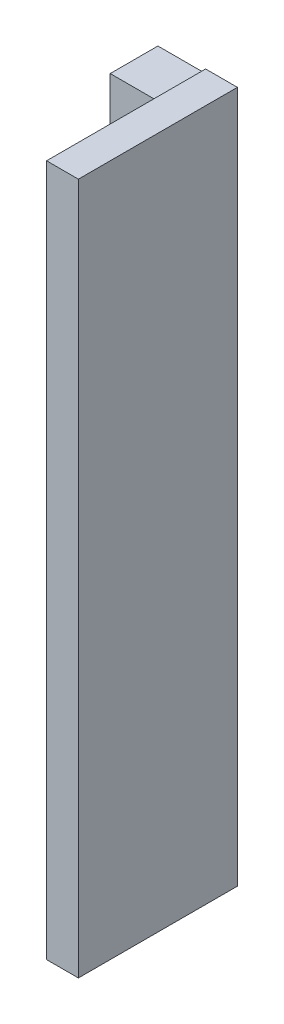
ISO-10303-21;
HEADER;
FILE_DESCRIPTION(('STEP AP214'),'2;1');
FILE_NAME('part.step','',(''),(''),'','','');
FILE_SCHEMA(('AUTOMOTIVE_DESIGN { 1 0 10303 214 1 1 1 1 }'));
ENDSEC;
DATA;
#1=APPLICATION_CONTEXT('core data for automotive mechanical design processes');
#2=APPLICATION_PROTOCOL_DEFINITION('international standard','automotive_design',2000,#1);
#3=PRODUCT_CONTEXT('',#1,'mechanical');
#4=PRODUCT('Part','Part','',(#3));
#5=PRODUCT_RELATED_PRODUCT_CATEGORY('part','',(#4));
#6=PRODUCT_DEFINITION_FORMATION('','',#4);
#7=PRODUCT_DEFINITION_CONTEXT('part definition',#1,'design');
#8=PRODUCT_DEFINITION('design','',#6,#7);
#9=PRODUCT_DEFINITION_SHAPE('','',#8);
#10=(LENGTH_UNIT() NAMED_UNIT(*) SI_UNIT(.MILLI.,.METRE.));
#11=(NAMED_UNIT(*) PLANE_ANGLE_UNIT() SI_UNIT($,.RADIAN.));
#12=(NAMED_UNIT(*) SI_UNIT($,.STERADIAN.) SOLID_ANGLE_UNIT());
#13=UNCERTAINTY_MEASURE_WITH_UNIT(LENGTH_MEASURE(1.E-05),#10,'distance_accuracy_value','');
#14=(GEOMETRIC_REPRESENTATION_CONTEXT(3) GLOBAL_UNCERTAINTY_ASSIGNED_CONTEXT((#13)) GLOBAL_UNIT_ASSIGNED_CONTEXT((#10,
#11,#12)) REPRESENTATION_CONTEXT('',''));
#15=CARTESIAN_POINT('',(0.,0.,0.));
#16=DIRECTION('',(0.,0.,1.));
#17=DIRECTION('',(1.,0.,0.));
#18=AXIS2_PLACEMENT_3D('',#15,#16,#17);
#19=CARTESIAN_POINT('',(3.89999999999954,-43.5,0.));
#20=DIRECTION('',(0.,1.,0.));
#21=DIRECTION('',(-1.,0.,0.));
#22=AXIS2_PLACEMENT_3D('',#19,#20,#21);
#23=PLANE('',#22);
#24=DIRECTION('',(1.,0.,0.));
#25=VECTOR('',#24,1.);
#26=CARTESIAN_POINT('',(3.89999999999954,-43.5,0.));
#27=LINE('',#26,#25);
#28=CARTESIAN_POINT('',(-4.55581752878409E-13,-43.5,0.));
#29=VERTEX_POINT('',#28);
#30=CARTESIAN_POINT('',(3.99999999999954,-43.5,0.));
#31=VERTEX_POINT('',#30);
#32=EDGE_CURVE('E46',#29,#31,#27,.T.);
#33=ORIENTED_EDGE('',*,*,#32,.T.);
#34=DIRECTION('',(0.,0.,-1.));
#35=VECTOR('',#34,1.);
#36=CARTESIAN_POINT('',(3.9999999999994,-43.5,20.));
#37=LINE('',#36,#35);
#38=CARTESIAN_POINT('',(3.9999999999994,-43.5,20.));
#39=VERTEX_POINT('',#38);
#40=EDGE_CURVE('E134',#39,#31,#37,.T.);
#41=ORIENTED_EDGE('',*,*,#40,.F.);
#42=DIRECTION('',(1.,0.,0.));
#43=VECTOR('',#42,1.);
#44=CARTESIAN_POINT('',(-5.60315682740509E-13,-43.5,20.));
#45=LINE('',#44,#43);
#46=CARTESIAN_POINT('',(-5.60315682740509E-13,-43.5,20.));
#47=VERTEX_POINT('',#46);
#48=EDGE_CURVE('E139',#47,#39,#45,.T.);
#49=ORIENTED_EDGE('',*,*,#48,.F.);
#50=DIRECTION('',(0.,0.,-1.));
#51=VECTOR('',#50,1.);
#52=CARTESIAN_POINT('',(-4.55581752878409E-13,-43.5,0.));
#53=LINE('',#52,#51);
#54=EDGE_CURVE('E109',#47,#29,#53,.T.);
#55=ORIENTED_EDGE('',*,*,#54,.T.);
#56=EDGE_LOOP('',(#33,#41,#49,#55));
#57=FACE_BOUND('',#56,.T.);
#58=ADVANCED_FACE('F16',(#57),#23,.F.);
#59=CARTESIAN_POINT('',(3.90000000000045,43.5,0.));
#60=DIRECTION('',(0.,1.,0.));
#61=DIRECTION('',(-1.,0.,0.));
#62=AXIS2_PLACEMENT_3D('',#59,#60,#61);
#63=PLANE('',#62);
#64=DIRECTION('',(-1.,0.,0.));
#65=VECTOR('',#64,1.);
#66=CARTESIAN_POINT('',(3.90000000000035,43.5,20.));
#67=LINE('',#66,#65);
#68=CARTESIAN_POINT('',(4.00000000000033,43.5,20.));
#69=VERTEX_POINT('',#68);
#70=CARTESIAN_POINT('',(3.50847823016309E-13,43.5,20.));
#71=VERTEX_POINT('',#70);
#72=EDGE_CURVE('E125',#69,#71,#67,.T.);
#73=ORIENTED_EDGE('',*,*,#72,.F.);
#74=DIRECTION('',(0.,0.,1.));
#75=VECTOR('',#74,1.);
#76=CARTESIAN_POINT('',(4.00000000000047,43.5,0.));
#77=LINE('',#76,#75);
#78=CARTESIAN_POINT('',(4.00000000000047,43.5,0.));
#79=VERTEX_POINT('',#78);
#80=EDGE_CURVE('E123',#79,#69,#77,.T.);
#81=ORIENTED_EDGE('',*,*,#80,.F.);
#82=DIRECTION('',(1.,0.,0.));
#83=VECTOR('',#82,1.);
#84=CARTESIAN_POINT('',(3.90000000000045,43.5,0.));
#85=LINE('',#84,#83);
#86=CARTESIAN_POINT('',(4.55581752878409E-13,43.5,0.));
#87=VERTEX_POINT('',#86);
#88=EDGE_CURVE('E20',#87,#79,#85,.T.);
#89=ORIENTED_EDGE('',*,*,#88,.F.);
#90=DIRECTION('',(0.,0.,-1.));
#91=VECTOR('',#90,1.);
#92=CARTESIAN_POINT('',(4.55581752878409E-13,43.5,0.));
#93=LINE('',#92,#91);
#94=EDGE_CURVE('E111',#71,#87,#93,.T.);
#95=ORIENTED_EDGE('',*,*,#94,.F.);
#96=EDGE_LOOP('',(#73,#81,#89,#95));
#97=FACE_BOUND('',#96,.T.);
#98=ADVANCED_FACE('F124',(#97),#63,.T.);
#99=CARTESIAN_POINT('',(3.90000000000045,43.5,0.));
#100=DIRECTION('',(0.,0.,1.));
#101=DIRECTION('',(1.,0.,0.));
#102=AXIS2_PLACEMENT_3D('',#99,#100,#101);
#103=PLANE('',#102);
#104=ORIENTED_EDGE('',*,*,#88,.T.);
#105=DIRECTION('',(0.,1.,0.));
#106=VECTOR('',#105,1.);
#107=CARTESIAN_POINT('',(3.99999999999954,-43.5,0.));
#108=LINE('',#107,#106);
#109=EDGE_CURVE('E117',#31,#79,#108,.T.);
#110=ORIENTED_EDGE('',*,*,#109,.F.);
#111=ORIENTED_EDGE('',*,*,#32,.F.);
#112=DIRECTION('',(0.,-1.,0.));
#113=VECTOR('',#112,1.);
#114=CARTESIAN_POINT('',(4.55581752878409E-13,43.5,0.));
#115=LINE('',#114,#113);
#116=CARTESIAN_POINT('',(-4.50377582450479E-13,-43.,0.));
#117=VERTEX_POINT('',#116);
#118=EDGE_CURVE('E107',#29,#117,#115,.F.);
#119=ORIENTED_EDGE('',*,*,#118,.T.);
#120=DIRECTION('',(1.,0.,0.));
#121=VECTOR('',#120,1.);
#122=CARTESIAN_POINT('',(-4.50377582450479E-13,-43.,0.));
#123=LINE('',#122,#121);
#124=CARTESIAN_POINT('',(-6.00000000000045,-43.,0.));
#125=VERTEX_POINT('',#124);
#126=EDGE_CURVE('E100',#125,#117,#123,.T.);
#127=ORIENTED_EDGE('',*,*,#126,.F.);
#128=DIRECTION('',(0.,-1.,0.));
#129=VECTOR('',#128,1.);
#130=CARTESIAN_POINT('',(-5.99999999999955,43.,-1.05821534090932E-13));
#131=LINE('',#130,#129);
#132=CARTESIAN_POINT('',(-5.99999999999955,43.,-1.09290981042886E-13));
#133=VERTEX_POINT('',#132);
#134=EDGE_CURVE('E34',#125,#133,#131,.F.);
#135=ORIENTED_EDGE('',*,*,#134,.T.);
#136=DIRECTION('',(1.,0.,0.));
#137=VECTOR('',#136,1.);
#138=CARTESIAN_POINT('',(4.50377582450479E-13,43.,0.));
#139=LINE('',#138,#137);
#140=CARTESIAN_POINT('',(4.50377582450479E-13,43.,0.));
#141=VERTEX_POINT('',#140);
#142=EDGE_CURVE('E10',#133,#141,#139,.T.);
#143=ORIENTED_EDGE('',*,*,#142,.T.);
#144=EDGE_CURVE('E97',#141,#87,#115,.F.);
#145=ORIENTED_EDGE('',*,*,#144,.T.);
#146=EDGE_LOOP('',(#104,#110,#111,#119,#127,#135,#143,#145));
#147=FACE_BOUND('',#146,.T.);
#148=ADVANCED_FACE('F18',(#147),#103,.F.);
#149=CARTESIAN_POINT('',(3.50847823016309E-13,43.5,15.));
#150=DIRECTION('',(1.,0.,0.));
#151=DIRECTION('',(0.,0.,-1.));
#152=AXIS2_PLACEMENT_3D('',#149,#150,#151);
#153=PLANE('',#152);
#154=DIRECTION('',(0.,0.,1.));
#155=VECTOR('',#154,1.);
#156=CARTESIAN_POINT('',(5.38197958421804E-13,43.,-9.));
#157=LINE('',#156,#155);
#158=CARTESIAN_POINT('',(4.08527378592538E-13,43.,6.));
#159=VERTEX_POINT('',#158);
#160=EDGE_CURVE('E94',#141,#159,#157,.T.);
#161=ORIENTED_EDGE('',*,*,#160,.T.);
#162=DIRECTION('',(0.,-1.,0.));
#163=VECTOR('',#162,1.);
#164=CARTESIAN_POINT('',(4.08527378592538E-13,43.,6.));
#165=LINE('',#164,#163);
#166=CARTESIAN_POINT('',(-4.92227786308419E-13,-43.,6.));
#167=VERTEX_POINT('',#166);
#168=EDGE_CURVE('E82',#167,#159,#165,.F.);
#169=ORIENTED_EDGE('',*,*,#168,.F.);
#170=DIRECTION('',(0.,0.,1.));
#171=VECTOR('',#170,1.);
#172=CARTESIAN_POINT('',(-3.8749385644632E-13,-43.,-9.));
#173=LINE('',#172,#171);
#174=EDGE_CURVE('E146',#117,#167,#173,.T.);
#175=ORIENTED_EDGE('',*,*,#174,.F.);
#176=ORIENTED_EDGE('',*,*,#118,.F.);
#177=ORIENTED_EDGE('',*,*,#54,.F.);
#178=DIRECTION('',(0.,-1.,0.));
#179=VECTOR('',#178,1.);
#180=CARTESIAN_POINT('',(3.50847823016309E-13,43.5,20.));
#181=LINE('',#180,#179);
#182=EDGE_CURVE('E57',#71,#47,#181,.T.);
#183=ORIENTED_EDGE('',*,*,#182,.F.);
#184=ORIENTED_EDGE('',*,*,#94,.T.);
#185=ORIENTED_EDGE('',*,*,#144,.F.);
#186=EDGE_LOOP('',(#161,#169,#175,#176,#177,#183,#184,#185));
#187=FACE_BOUND('',#186,.T.);
#188=ADVANCED_FACE('F95',(#187),#153,.F.);
#189=CARTESIAN_POINT('',(-3.8749385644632E-13,-43.,-9.));
#190=DIRECTION('',(0.,1.,0.));
#191=DIRECTION('',(-1.,0.,0.));
#192=AXIS2_PLACEMENT_3D('',#189,#190,#191);
#193=PLANE('',#192);
#194=DIRECTION('',(0.,0.,-1.));
#195=VECTOR('',#194,1.);
#196=CARTESIAN_POINT('',(-6.00000000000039,-43.,-9.));
#197=LINE('',#196,#195);
#198=CARTESIAN_POINT('',(-6.00000000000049,-43.,6.));
#199=VERTEX_POINT('',#198);
#200=EDGE_CURVE('E149',#199,#125,#197,.T.);
#201=ORIENTED_EDGE('',*,*,#200,.T.);
#202=ORIENTED_EDGE('',*,*,#126,.T.);
#203=ORIENTED_EDGE('',*,*,#174,.T.);
#204=DIRECTION('',(-1.,0.,0.));
#205=VECTOR('',#204,1.);
#206=CARTESIAN_POINT('',(-4.92227786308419E-13,-43.,6.));
#207=LINE('',#206,#205);
#208=EDGE_CURVE('E90',#167,#199,#207,.T.);
#209=ORIENTED_EDGE('',*,*,#208,.T.);
#210=EDGE_LOOP('',(#201,#202,#203,#209));
#211=FACE_BOUND('',#210,.T.);
#212=ADVANCED_FACE('F152',(#211),#193,.F.);
#213=CARTESIAN_POINT('',(5.38197958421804E-13,43.,-9.));
#214=DIRECTION('',(0.,1.,0.));
#215=DIRECTION('',(-1.,0.,0.));
#216=AXIS2_PLACEMENT_3D('',#213,#214,#215);
#217=PLANE('',#216);
#218=ORIENTED_EDGE('',*,*,#142,.F.);
#219=DIRECTION('',(0.,0.,-1.));
#220=VECTOR('',#219,1.);
#221=CARTESIAN_POINT('',(-5.99999999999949,43.,-9.));
#222=LINE('',#221,#220);
#223=CARTESIAN_POINT('',(-5.99999999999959,43.,6.));
#224=VERTEX_POINT('',#223);
#225=EDGE_CURVE('E26',#224,#133,#222,.T.);
#226=ORIENTED_EDGE('',*,*,#225,.F.);
#227=DIRECTION('',(-1.,0.,0.));
#228=VECTOR('',#227,1.);
#229=CARTESIAN_POINT('',(4.08527378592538E-13,43.,6.));
#230=LINE('',#229,#228);
#231=EDGE_CURVE('E87',#159,#224,#230,.T.);
#232=ORIENTED_EDGE('',*,*,#231,.F.);
#233=ORIENTED_EDGE('',*,*,#160,.F.);
#234=EDGE_LOOP('',(#218,#226,#232,#233));
#235=FACE_BOUND('',#234,.T.);
#236=ADVANCED_FACE('F102',(#235),#217,.T.);
#237=CARTESIAN_POINT('',(4.08527378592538E-13,43.,6.));
#238=DIRECTION('',(0.,0.,-1.));
#239=DIRECTION('',(-1.,0.,0.));
#240=AXIS2_PLACEMENT_3D('',#237,#238,#239);
#241=PLANE('',#240);
#242=ORIENTED_EDGE('',*,*,#231,.T.);
#243=DIRECTION('',(0.,-1.,0.));
#244=VECTOR('',#243,1.);
#245=CARTESIAN_POINT('',(-5.99999999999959,43.,6.));
#246=LINE('',#245,#244);
#247=EDGE_CURVE('E144',#199,#224,#246,.F.);
#248=ORIENTED_EDGE('',*,*,#247,.F.);
#249=ORIENTED_EDGE('',*,*,#208,.F.);
#250=ORIENTED_EDGE('',*,*,#168,.T.);
#251=EDGE_LOOP('',(#242,#248,#249,#250));
#252=FACE_BOUND('',#251,.T.);
#253=ADVANCED_FACE('F84',(#252),#241,.F.);
#254=CARTESIAN_POINT('',(-5.99999999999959,43.,6.));
#255=DIRECTION('',(1.,0.,0.));
#256=DIRECTION('',(0.,0.,-1.));
#257=AXIS2_PLACEMENT_3D('',#254,#255,#256);
#258=PLANE('',#257);
#259=ORIENTED_EDGE('',*,*,#225,.T.);
#260=ORIENTED_EDGE('',*,*,#134,.F.);
#261=ORIENTED_EDGE('',*,*,#200,.F.);
#262=ORIENTED_EDGE('',*,*,#247,.T.);
#263=EDGE_LOOP('',(#259,#260,#261,#262));
#264=FACE_BOUND('',#263,.T.);
#265=ADVANCED_FACE('F155',(#264),#258,.F.);
#266=CARTESIAN_POINT('',(0.,0.,20.));
#267=DIRECTION('',(0.,0.,1.));
#268=DIRECTION('',(1.,0.,0.));
#269=AXIS2_PLACEMENT_3D('',#266,#267,#268);
#270=PLANE('',#269);
#271=ORIENTED_EDGE('',*,*,#182,.T.);
#272=ORIENTED_EDGE('',*,*,#48,.T.);
#273=DIRECTION('',(0.,-1.,0.));
#274=VECTOR('',#273,1.);
#275=CARTESIAN_POINT('',(4.00000000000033,43.5,20.));
#276=LINE('',#275,#274);
#277=EDGE_CURVE('E129',#69,#39,#276,.T.);
#278=ORIENTED_EDGE('',*,*,#277,.F.);
#279=ORIENTED_EDGE('',*,*,#72,.T.);
#280=EDGE_LOOP('',(#271,#272,#278,#279));
#281=FACE_BOUND('',#280,.T.);
#282=ADVANCED_FACE('F157',(#281),#270,.T.);
#283=CARTESIAN_POINT('',(4.,0.,0.));
#284=DIRECTION('',(1.,0.,0.));
#285=DIRECTION('',(0.,1.,0.));
#286=AXIS2_PLACEMENT_3D('',#283,#284,#285);
#287=PLANE('',#286);
#288=ORIENTED_EDGE('',*,*,#109,.T.);
#289=ORIENTED_EDGE('',*,*,#80,.T.);
#290=ORIENTED_EDGE('',*,*,#277,.T.);
#291=ORIENTED_EDGE('',*,*,#40,.T.);
#292=EDGE_LOOP('',(#288,#289,#290,#291));
#293=FACE_BOUND('',#292,.T.);
#294=ADVANCED_FACE('F132',(#293),#287,.T.);
#295=CLOSED_SHELL('',(#58,#98,#148,#188,#212,#236,#253,#265,#282,#294));
#296=MANIFOLD_SOLID_BREP('B1',#295);
#297=ADVANCED_BREP_SHAPE_REPRESENTATION('',(#18,#296),#14);
#298=SHAPE_DEFINITION_REPRESENTATION(#9,#297);
ENDSEC;
END-ISO-10303-21;
